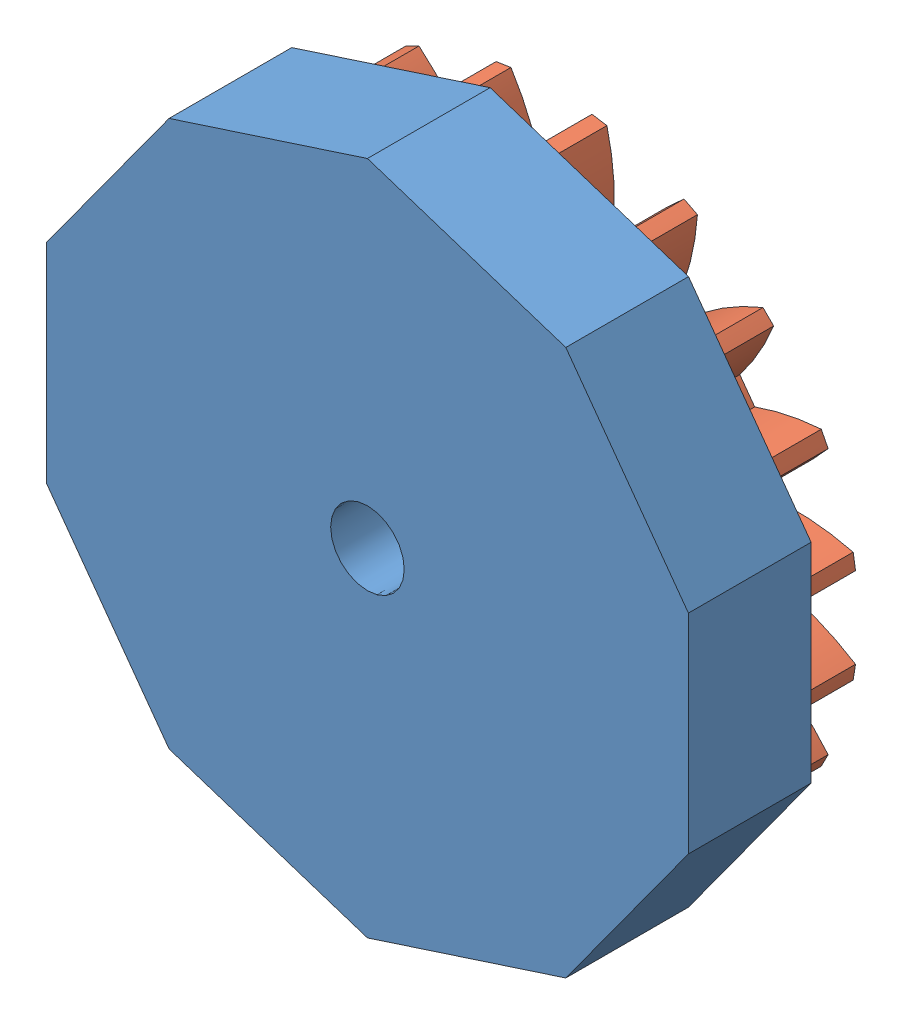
SolidWorks assembly 齒輪組5.SLDASM, configuration 預設 (file format 15000). Lengths in mm.
Overall size (104.64 110.03 30).
2 component instances, 2 part files, 2 mates.
Components (placement in the parent):
- 轉盤1-1: 轉盤1.SLDPRT [預設] at (-6.5979 -2.2249 100.0263) size (104.64 110.03 20)
- 齒輪2-1: 齒輪2.SLDPRT [預設] at (-6.5979 13.2751 90.0263) size (99.12 99.12 10)
Mates (geometry in assembly coordinates):
- 重合/共線/共點2: coincident anti-aligned: plane of 轉盤1-1 through (-6.5979 -2.2249 100.0263) normal (0 0 -1); plane of 齒輪2-1 through (-6.5979 13.2751 100.0263) normal (0 0 1)
- 同軸心1: concentric aligned: cylinder of 轉盤1-1 through (-6.5979 -2.2249 120.0263) axis (0 0 -1) radius 6; cylinder of 齒輪2-1 through (-6.5979 -2.2249 100.0263) axis (0 0 -1) radius 7
